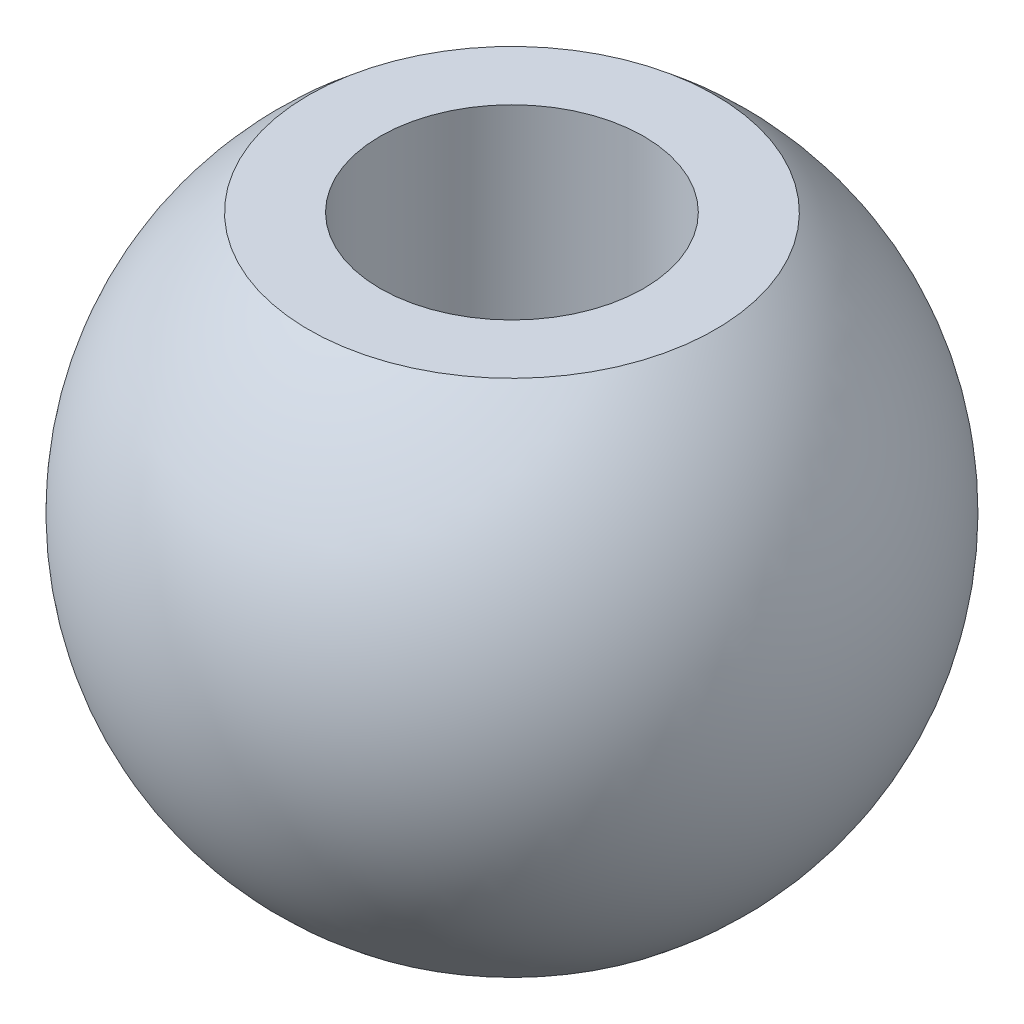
from build123d import *


with BuildPart() as part:
    # Sketch1 → Revolve1 (revolve)
    with BuildSketch(Plane.XY, mode=Mode.PRIVATE) as revolve1_sk:
        with BuildLine():
            Line((-1.5875, 3.1242), (-2.447519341, 3.1242))
            ThreePointArc((-2.447519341, 3.1242), (-3.96875, 0), (-2.447519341, -3.1242))
            Line((-2.447519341, -3.1242), (-1.5875, -3.1242))
            Line((-1.5875, -3.1242), (-1.5875, 3.1242))
        make_face()
    revolve(revolve1_sk.sketch.rotate(Axis((0, 0, 0), (0, 1, 0)), 270), axis=Axis((0, 0, 0), (0, 1, 0)))


solid = part.part
